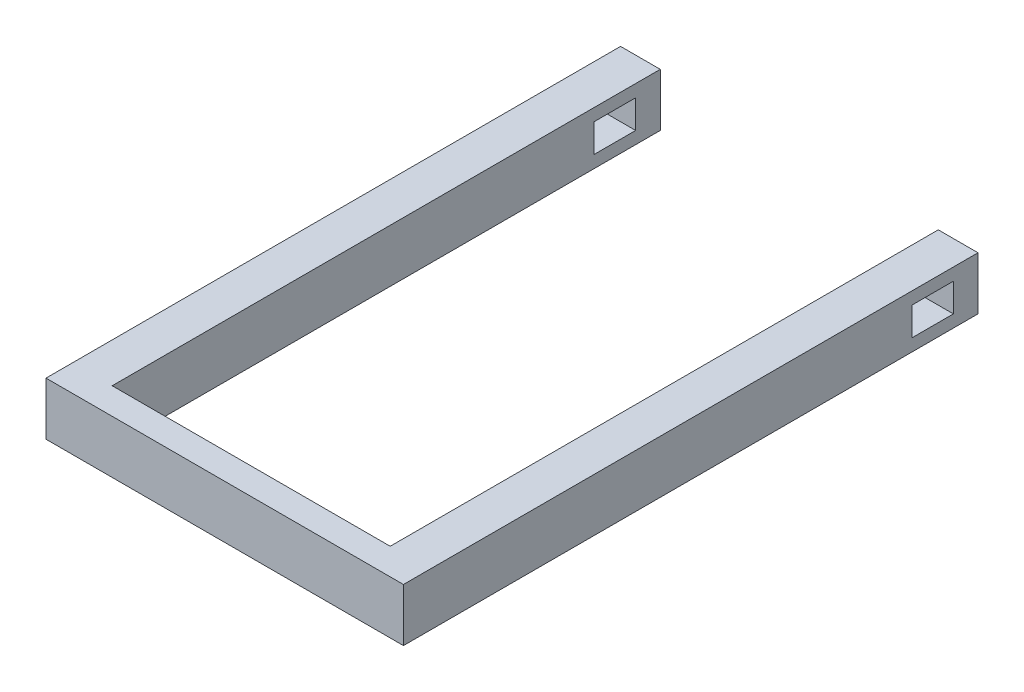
from build123d import *

# Parameters (mm, degrees)
AUFSATZ_LINEAR_AUSTRAGEN1_DEPTH = 4
SKIZZE2_W                       = 3.14
SKIZZE2_H                       = 2.14
SCHNITT_LINEAR_AUSTRAGEN1_DEPTH = 52.269484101


with BuildPart() as part:
    # Skizze1 → Aufsatz-Linear austragen1 (new body)
    with BuildSketch(Plane(origin=(0, 0, 0), x_dir=(1, 0, 0), z_dir=(0, 1, 0))):
        Polygon((-13.5, 43.4), (-13.5, 0), (13.5, 0), (13.5, 43.4), (10.5, 43.4), (10.5, 2), (-10.5, 2), (-10.5, 43.4), align=None)
    extrude(amount=AUFSATZ_LINEAR_AUSTRAGEN1_DEPTH)

    # Skizze2 → Schnitt-Linear austragen1 (cut, through all)
    with BuildSketch(Plane(origin=(13.5, 0, 0), x_dir=(0, 0, -1), z_dir=(1, 0, 0))):
        with Locations((39.97, 2)):
            Rectangle(SKIZZE2_W, SKIZZE2_H)
    extrude(amount=-SCHNITT_LINEAR_AUSTRAGEN1_DEPTH, mode=Mode.SUBTRACT)


solid = part.part
